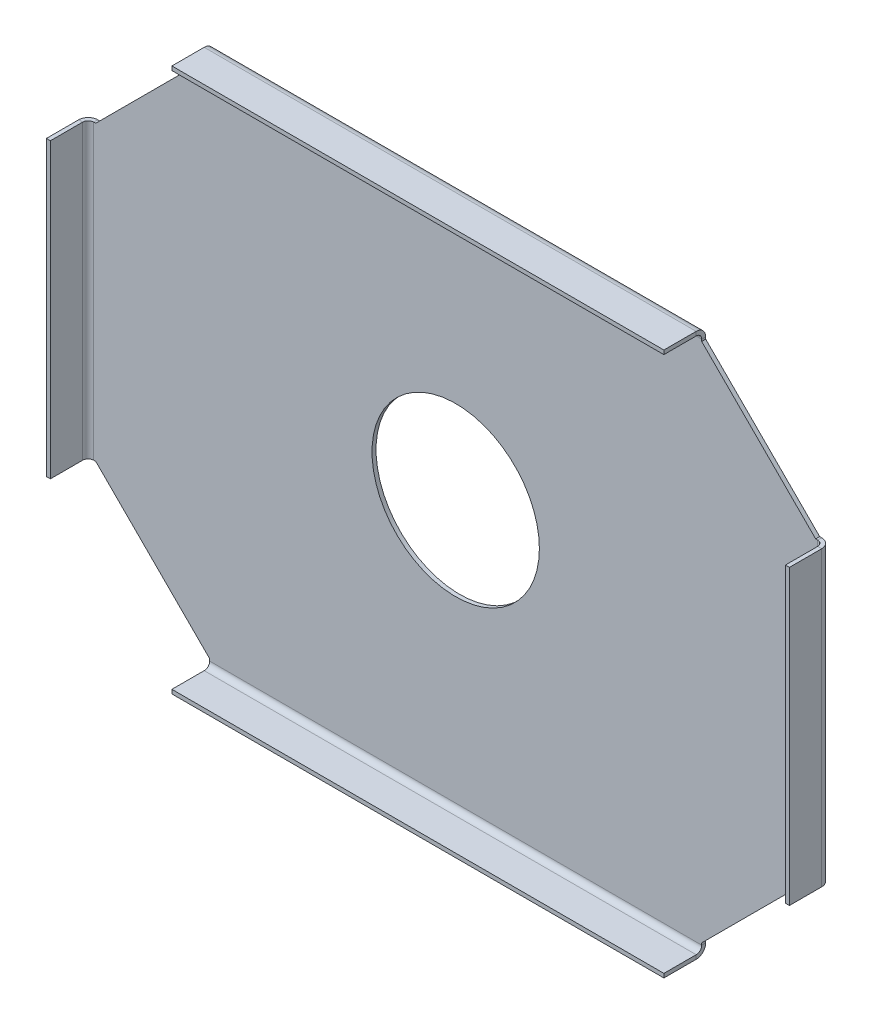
ISO-10303-21;
HEADER;
FILE_DESCRIPTION(('STEP AP214'),'2;1');
FILE_NAME('part.step','',(''),(''),'','','');
FILE_SCHEMA(('AUTOMOTIVE_DESIGN { 1 0 10303 214 1 1 1 1 }'));
ENDSEC;
DATA;
#1=APPLICATION_CONTEXT('core data for automotive mechanical design processes');
#2=APPLICATION_PROTOCOL_DEFINITION('international standard','automotive_design',2000,#1);
#3=PRODUCT_CONTEXT('',#1,'mechanical');
#4=PRODUCT('Part','Part','',(#3));
#5=PRODUCT_RELATED_PRODUCT_CATEGORY('part','',(#4));
#6=PRODUCT_DEFINITION_FORMATION('','',#4);
#7=PRODUCT_DEFINITION_CONTEXT('part definition',#1,'design');
#8=PRODUCT_DEFINITION('design','',#6,#7);
#9=PRODUCT_DEFINITION_SHAPE('','',#8);
#10=(LENGTH_UNIT() NAMED_UNIT(*) SI_UNIT(.MILLI.,.METRE.));
#11=(NAMED_UNIT(*) PLANE_ANGLE_UNIT() SI_UNIT($,.RADIAN.));
#12=(NAMED_UNIT(*) SI_UNIT($,.STERADIAN.) SOLID_ANGLE_UNIT());
#13=UNCERTAINTY_MEASURE_WITH_UNIT(LENGTH_MEASURE(1.E-05),#10,'distance_accuracy_value','');
#14=(GEOMETRIC_REPRESENTATION_CONTEXT(3) GLOBAL_UNCERTAINTY_ASSIGNED_CONTEXT((#13)) GLOBAL_UNIT_ASSIGNED_CONTEXT((#10,
#11,#12)) REPRESENTATION_CONTEXT('',''));
#15=CARTESIAN_POINT('',(0.,0.,0.));
#16=DIRECTION('',(0.,0.,1.));
#17=DIRECTION('',(1.,0.,0.));
#18=AXIS2_PLACEMENT_3D('',#15,#16,#17);
#19=CARTESIAN_POINT('',(0.,0.,-1.2192));
#20=DIRECTION('',(0.,0.,1.));
#21=DIRECTION('',(1.,0.,0.));
#22=AXIS2_PLACEMENT_3D('',#19,#20,#21);
#23=PLANE('',#22);
#24=CARTESIAN_POINT('',(0.,0.,-1.21920000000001));
#25=DIRECTION('',(0.,0.,1.));
#26=DIRECTION('',(1.,0.,0.));
#27=AXIS2_PLACEMENT_3D('',#24,#25,#26);
#28=CIRCLE('',#27,25.4);
#29=CARTESIAN_POINT('',(25.4,0.,-1.21920000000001));
#30=VERTEX_POINT('',#29);
#31=EDGE_CURVE('E385',#30,#30,#28,.T.);
#32=ORIENTED_EDGE('',*,*,#31,.T.);
#33=EDGE_LOOP('',(#32));
#34=FACE_BOUND('',#33,.T.);
#35=DIRECTION('',(0.,1.,0.));
#36=VECTOR('',#35,1.);
#37=CARTESIAN_POINT('',(74.6759999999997,0.,-1.2192));
#38=LINE('',#37,#36);
#39=CARTESIAN_POINT('',(74.6759999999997,79.0448000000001,-1.2192));
#40=VERTEX_POINT('',#39);
#41=CARTESIAN_POINT('',(74.6759999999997,79.6544000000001,-1.2192));
#42=VERTEX_POINT('',#41);
#43=EDGE_CURVE('E384',#40,#42,#38,.T.);
#44=ORIENTED_EDGE('',*,*,#43,.F.);
#45=DIRECTION('',(0.707106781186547,-0.707106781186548,0.));
#46=VECTOR('',#45,1.);
#47=CARTESIAN_POINT('',(74.6759999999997,79.0448,-1.21920000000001));
#48=LINE('',#47,#46);
#49=CARTESIAN_POINT('',(109.2708,44.4499999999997,-1.21920000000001));
#50=VERTEX_POINT('',#49);
#51=EDGE_CURVE('E376',#40,#50,#48,.T.);
#52=ORIENTED_EDGE('',*,*,#51,.T.);
#53=DIRECTION('',(-1.,0.,0.));
#54=VECTOR('',#53,1.);
#55=CARTESIAN_POINT('',(0.,44.4499999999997,-1.2192));
#56=LINE('',#55,#54);
#57=CARTESIAN_POINT('',(109.8804,44.4499999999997,-1.21920000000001));
#58=VERTEX_POINT('',#57);
#59=EDGE_CURVE('E13',#58,#50,#56,.T.);
#60=ORIENTED_EDGE('',*,*,#59,.F.);
#61=DIRECTION('',(0.,1.,0.));
#62=VECTOR('',#61,1.);
#63=CARTESIAN_POINT('',(109.8804,44.4499999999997,-1.21920000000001));
#64=LINE('',#63,#62);
#65=CARTESIAN_POINT('',(109.8804,-44.4499999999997,-1.2192));
#66=VERTEX_POINT('',#65);
#67=EDGE_CURVE('E400',#58,#66,#64,.F.);
#68=ORIENTED_EDGE('',*,*,#67,.T.);
#69=DIRECTION('',(1.,0.,0.));
#70=VECTOR('',#69,1.);
#71=CARTESIAN_POINT('',(0.,-44.4499999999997,-1.2192));
#72=LINE('',#71,#70);
#73=CARTESIAN_POINT('',(109.2708,-44.4499999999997,-1.21920000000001));
#74=VERTEX_POINT('',#73);
#75=EDGE_CURVE('E129',#74,#66,#72,.T.);
#76=ORIENTED_EDGE('',*,*,#75,.F.);
#77=DIRECTION('',(-0.707106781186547,-0.707106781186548,0.));
#78=VECTOR('',#77,1.);
#79=CARTESIAN_POINT('',(74.6759999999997,-79.0448,-1.21920000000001));
#80=LINE('',#79,#78);
#81=CARTESIAN_POINT('',(74.6759999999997,-79.0448,-1.21920000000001));
#82=VERTEX_POINT('',#81);
#83=EDGE_CURVE('E340',#74,#82,#80,.T.);
#84=ORIENTED_EDGE('',*,*,#83,.T.);
#85=DIRECTION('',(0.,1.,0.));
#86=VECTOR('',#85,1.);
#87=CARTESIAN_POINT('',(74.6759999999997,0.,-1.2192));
#88=LINE('',#87,#86);
#89=CARTESIAN_POINT('',(74.6759999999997,-79.6544,-1.21920000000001));
#90=VERTEX_POINT('',#89);
#91=EDGE_CURVE('E355',#90,#82,#88,.T.);
#92=ORIENTED_EDGE('',*,*,#91,.F.);
#93=DIRECTION('',(1.,0.,0.));
#94=VECTOR('',#93,1.);
#95=CARTESIAN_POINT('',(74.6759999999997,-79.6544,-1.21920000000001));
#96=LINE('',#95,#94);
#97=CARTESIAN_POINT('',(-74.6759999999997,-79.6544,-1.2192));
#98=VERTEX_POINT('',#97);
#99=EDGE_CURVE('E353',#90,#98,#96,.F.);
#100=ORIENTED_EDGE('',*,*,#99,.T.);
#101=DIRECTION('',(0.,-1.,0.));
#102=VECTOR('',#101,1.);
#103=CARTESIAN_POINT('',(-74.6759999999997,0.,-1.2192));
#104=LINE('',#103,#102);
#105=CARTESIAN_POINT('',(-74.6759999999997,-79.0448,-1.21920000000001));
#106=VERTEX_POINT('',#105);
#107=EDGE_CURVE('E345',#106,#98,#104,.T.);
#108=ORIENTED_EDGE('',*,*,#107,.F.);
#109=DIRECTION('',(-0.707106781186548,0.707106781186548,0.));
#110=VECTOR('',#109,1.);
#111=CARTESIAN_POINT('',(-109.2708,-44.4499999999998,-1.21920000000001));
#112=LINE('',#111,#110);
#113=CARTESIAN_POINT('',(-109.2708,-44.4499999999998,-1.21920000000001));
#114=VERTEX_POINT('',#113);
#115=EDGE_CURVE('E329',#106,#114,#112,.T.);
#116=ORIENTED_EDGE('',*,*,#115,.T.);
#117=DIRECTION('',(1.,0.,0.));
#118=VECTOR('',#117,1.);
#119=CARTESIAN_POINT('',(0.,-44.4499999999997,-1.2192));
#120=LINE('',#119,#118);
#121=CARTESIAN_POINT('',(-109.8804,-44.4499999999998,-1.21919999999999));
#122=VERTEX_POINT('',#121);
#123=EDGE_CURVE('E349',#122,#114,#120,.T.);
#124=ORIENTED_EDGE('',*,*,#123,.F.);
#125=DIRECTION('',(0.,-1.,0.));
#126=VECTOR('',#125,1.);
#127=CARTESIAN_POINT('',(-109.8804,-44.4499999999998,-1.21919999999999));
#128=LINE('',#127,#126);
#129=CARTESIAN_POINT('',(-109.8804,44.4499999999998,-1.2192));
#130=VERTEX_POINT('',#129);
#131=EDGE_CURVE('E1215',#122,#130,#128,.F.);
#132=ORIENTED_EDGE('',*,*,#131,.T.);
#133=DIRECTION('',(-1.,0.,0.));
#134=VECTOR('',#133,1.);
#135=CARTESIAN_POINT('',(0.,44.4499999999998,-1.2192));
#136=LINE('',#135,#134);
#137=CARTESIAN_POINT('',(-109.2708,44.4499999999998,-1.21920000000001));
#138=VERTEX_POINT('',#137);
#139=EDGE_CURVE('E439',#138,#130,#136,.T.);
#140=ORIENTED_EDGE('',*,*,#139,.F.);
#141=DIRECTION('',(0.707106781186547,0.707106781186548,0.));
#142=VECTOR('',#141,1.);
#143=CARTESIAN_POINT('',(-109.2708,44.4499999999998,-1.21920000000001));
#144=LINE('',#143,#142);
#145=CARTESIAN_POINT('',(-74.6759999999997,79.0448,-1.21920000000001));
#146=VERTEX_POINT('',#145);
#147=EDGE_CURVE('E339',#138,#146,#144,.T.);
#148=ORIENTED_EDGE('',*,*,#147,.T.);
#149=DIRECTION('',(0.,-1.,0.));
#150=VECTOR('',#149,1.);
#151=CARTESIAN_POINT('',(-74.6759999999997,0.,-1.2192));
#152=LINE('',#151,#150);
#153=CARTESIAN_POINT('',(-74.6759999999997,79.6544000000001,-1.21919999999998));
#154=VERTEX_POINT('',#153);
#155=EDGE_CURVE('E433',#154,#146,#152,.T.);
#156=ORIENTED_EDGE('',*,*,#155,.F.);
#157=DIRECTION('',(-1.,0.,0.));
#158=VECTOR('',#157,1.);
#159=CARTESIAN_POINT('',(-74.6759999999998,79.6544000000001,-1.21919999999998));
#160=LINE('',#159,#158);
#161=EDGE_CURVE('E1162',#154,#42,#160,.F.);
#162=ORIENTED_EDGE('',*,*,#161,.T.);
#163=EDGE_LOOP('',(#44,#52,#60,#68,#76,#84,#92,#100,#108,#116,#124,#132,#140,#148,#156,#162));
#164=FACE_BOUND('',#163,.T.);
#165=ADVANCED_FACE('F120',(#34,#164),#23,.F.);
#166=CARTESIAN_POINT('',(0.,0.,0.));
#167=DIRECTION('',(0.,0.,1.));
#168=DIRECTION('',(1.,0.,0.));
#169=AXIS2_PLACEMENT_3D('',#166,#167,#168);
#170=PLANE('',#169);
#171=CARTESIAN_POINT('',(0.,0.,0.));
#172=DIRECTION('',(0.,0.,1.));
#173=DIRECTION('',(1.,0.,0.));
#174=AXIS2_PLACEMENT_3D('',#171,#172,#173);
#175=CIRCLE('',#174,25.4);
#176=CARTESIAN_POINT('',(25.4,0.,0.));
#177=VERTEX_POINT('',#176);
#178=EDGE_CURVE('E124',#177,#177,#175,.T.);
#179=ORIENTED_EDGE('',*,*,#178,.F.);
#180=EDGE_LOOP('',(#179));
#181=FACE_BOUND('',#180,.T.);
#182=DIRECTION('',(0.707106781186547,-0.707106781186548,0.));
#183=VECTOR('',#182,1.);
#184=CARTESIAN_POINT('',(76.8603999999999,76.8603999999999,0.));
#185=LINE('',#184,#183);
#186=CARTESIAN_POINT('',(74.6759999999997,79.0448,0.));
#187=VERTEX_POINT('',#186);
#188=CARTESIAN_POINT('',(109.2708,44.4499999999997,0.));
#189=VERTEX_POINT('',#188);
#190=EDGE_CURVE('E379',#187,#189,#185,.T.);
#191=ORIENTED_EDGE('',*,*,#190,.F.);
#192=DIRECTION('',(0.,-1.,0.));
#193=VECTOR('',#192,1.);
#194=CARTESIAN_POINT('',(74.6759999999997,79.6544,0.));
#195=LINE('',#194,#193);
#196=CARTESIAN_POINT('',(74.6759999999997,79.6544,0.));
#197=VERTEX_POINT('',#196);
#198=EDGE_CURVE('E427',#197,#187,#195,.T.);
#199=ORIENTED_EDGE('',*,*,#198,.F.);
#200=DIRECTION('',(-1.,0.,0.));
#201=VECTOR('',#200,1.);
#202=CARTESIAN_POINT('',(-74.6759999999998,79.6544,0.));
#203=LINE('',#202,#201);
#204=CARTESIAN_POINT('',(-74.6759999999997,79.6544,0.));
#205=VERTEX_POINT('',#204);
#206=EDGE_CURVE('E1174',#205,#197,#203,.F.);
#207=ORIENTED_EDGE('',*,*,#206,.F.);
#208=DIRECTION('',(0.,1.,0.));
#209=VECTOR('',#208,1.);
#210=CARTESIAN_POINT('',(-74.6759999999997,79.0448,0.));
#211=LINE('',#210,#209);
#212=CARTESIAN_POINT('',(-74.6759999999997,79.0448,0.));
#213=VERTEX_POINT('',#212);
#214=EDGE_CURVE('E424',#213,#205,#211,.T.);
#215=ORIENTED_EDGE('',*,*,#214,.F.);
#216=DIRECTION('',(0.707106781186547,0.707106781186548,0.));
#217=VECTOR('',#216,1.);
#218=CARTESIAN_POINT('',(-76.8603999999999,76.8603999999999,0.));
#219=LINE('',#218,#217);
#220=CARTESIAN_POINT('',(-109.2708,44.4499999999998,0.));
#221=VERTEX_POINT('',#220);
#222=EDGE_CURVE('E1126',#221,#213,#219,.T.);
#223=ORIENTED_EDGE('',*,*,#222,.F.);
#224=DIRECTION('',(1.,0.,0.));
#225=VECTOR('',#224,1.);
#226=CARTESIAN_POINT('',(-109.8804,44.4499999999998,0.));
#227=LINE('',#226,#225);
#228=CARTESIAN_POINT('',(-109.8804,44.4499999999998,0.));
#229=VERTEX_POINT('',#228);
#230=EDGE_CURVE('E440',#229,#221,#227,.T.);
#231=ORIENTED_EDGE('',*,*,#230,.F.);
#232=DIRECTION('',(0.,-1.,0.));
#233=VECTOR('',#232,1.);
#234=CARTESIAN_POINT('',(-109.8804,-44.4499999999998,0.));
#235=LINE('',#234,#233);
#236=CARTESIAN_POINT('',(-109.8804,-44.4499999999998,0.));
#237=VERTEX_POINT('',#236);
#238=EDGE_CURVE('E1228',#237,#229,#235,.F.);
#239=ORIENTED_EDGE('',*,*,#238,.F.);
#240=DIRECTION('',(-1.,0.,0.));
#241=VECTOR('',#240,1.);
#242=CARTESIAN_POINT('',(-109.2708,-44.4499999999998,0.));
#243=LINE('',#242,#241);
#244=CARTESIAN_POINT('',(-109.2708,-44.4499999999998,0.));
#245=VERTEX_POINT('',#244);
#246=EDGE_CURVE('E437',#245,#237,#243,.T.);
#247=ORIENTED_EDGE('',*,*,#246,.F.);
#248=DIRECTION('',(-0.707106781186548,0.707106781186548,0.));
#249=VECTOR('',#248,1.);
#250=CARTESIAN_POINT('',(-76.8603999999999,-76.8603999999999,0.));
#251=LINE('',#250,#249);
#252=CARTESIAN_POINT('',(-74.6759999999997,-79.0448,0.));
#253=VERTEX_POINT('',#252);
#254=EDGE_CURVE('E1128',#253,#245,#251,.T.);
#255=ORIENTED_EDGE('',*,*,#254,.F.);
#256=DIRECTION('',(0.,1.,0.));
#257=VECTOR('',#256,1.);
#258=CARTESIAN_POINT('',(-74.6759999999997,-79.6544,0.));
#259=LINE('',#258,#257);
#260=CARTESIAN_POINT('',(-74.6759999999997,-79.6544,0.));
#261=VERTEX_POINT('',#260);
#262=EDGE_CURVE('E348',#261,#253,#259,.T.);
#263=ORIENTED_EDGE('',*,*,#262,.F.);
#264=DIRECTION('',(1.,0.,0.));
#265=VECTOR('',#264,1.);
#266=CARTESIAN_POINT('',(74.6759999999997,-79.6544,0.));
#267=LINE('',#266,#265);
#268=CARTESIAN_POINT('',(74.6759999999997,-79.6544,0.));
#269=VERTEX_POINT('',#268);
#270=EDGE_CURVE('E483',#269,#261,#267,.F.);
#271=ORIENTED_EDGE('',*,*,#270,.F.);
#272=DIRECTION('',(0.,-1.,0.));
#273=VECTOR('',#272,1.);
#274=CARTESIAN_POINT('',(74.6759999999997,-79.0448,0.));
#275=LINE('',#274,#273);
#276=CARTESIAN_POINT('',(74.6759999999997,-79.0448,0.));
#277=VERTEX_POINT('',#276);
#278=EDGE_CURVE('E356',#277,#269,#275,.T.);
#279=ORIENTED_EDGE('',*,*,#278,.F.);
#280=DIRECTION('',(-0.707106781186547,-0.707106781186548,0.));
#281=VECTOR('',#280,1.);
#282=CARTESIAN_POINT('',(76.8603999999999,-76.8603999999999,0.));
#283=LINE('',#282,#281);
#284=CARTESIAN_POINT('',(109.2708,-44.4499999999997,0.));
#285=VERTEX_POINT('',#284);
#286=EDGE_CURVE('E453',#285,#277,#283,.T.);
#287=ORIENTED_EDGE('',*,*,#286,.F.);
#288=DIRECTION('',(-1.,0.,0.));
#289=VECTOR('',#288,1.);
#290=CARTESIAN_POINT('',(109.8804,-44.4499999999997,0.));
#291=LINE('',#290,#289);
#292=CARTESIAN_POINT('',(109.8804,-44.4499999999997,0.));
#293=VERTEX_POINT('',#292);
#294=EDGE_CURVE('E368',#293,#285,#291,.T.);
#295=ORIENTED_EDGE('',*,*,#294,.F.);
#296=DIRECTION('',(0.,1.,0.));
#297=VECTOR('',#296,1.);
#298=CARTESIAN_POINT('',(109.8804,44.4499999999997,0.));
#299=LINE('',#298,#297);
#300=CARTESIAN_POINT('',(109.8804,44.4499999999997,0.));
#301=VERTEX_POINT('',#300);
#302=EDGE_CURVE('E413',#301,#293,#299,.F.);
#303=ORIENTED_EDGE('',*,*,#302,.F.);
#304=DIRECTION('',(1.,0.,0.));
#305=VECTOR('',#304,1.);
#306=CARTESIAN_POINT('',(109.2708,44.4499999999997,0.));
#307=LINE('',#306,#305);
#308=EDGE_CURVE('E365',#189,#301,#307,.T.);
#309=ORIENTED_EDGE('',*,*,#308,.F.);
#310=EDGE_LOOP('',(#191,#199,#207,#215,#223,#231,#239,#247,#255,#263,#271,#279,#287,#295,#303,#309));
#311=FACE_BOUND('',#310,.T.);
#312=ADVANCED_FACE('F122',(#181,#311),#170,.T.);
#313=CARTESIAN_POINT('',(109.2708,44.4499999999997,0.));
#314=DIRECTION('',(0.,1.,0.));
#315=DIRECTION('',(0.,0.,1.));
#316=AXIS2_PLACEMENT_3D('',#313,#314,#315);
#317=PLANE('',#316);
#318=DIRECTION('',(0.,0.,-1.));
#319=VECTOR('',#318,1.);
#320=CARTESIAN_POINT('',(109.8804,44.4499999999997,0.));
#321=LINE('',#320,#319);
#322=EDGE_CURVE('E389',#301,#58,#321,.T.);
#323=ORIENTED_EDGE('',*,*,#322,.T.);
#324=ORIENTED_EDGE('',*,*,#59,.T.);
#325=DIRECTION('',(0.,0.,-1.));
#326=VECTOR('',#325,1.);
#327=CARTESIAN_POINT('',(109.2708,44.4499999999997,0.));
#328=LINE('',#327,#326);
#329=EDGE_CURVE('E367',#189,#50,#328,.T.);
#330=ORIENTED_EDGE('',*,*,#329,.F.);
#331=ORIENTED_EDGE('',*,*,#308,.T.);
#332=EDGE_LOOP('',(#323,#324,#330,#331));
#333=FACE_BOUND('',#332,.T.);
#334=ADVANCED_FACE('F387',(#333),#317,.T.);
#335=CARTESIAN_POINT('',(109.8804,-44.4499999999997,0.));
#336=DIRECTION('',(0.,-1.,0.));
#337=DIRECTION('',(0.,0.,-1.));
#338=AXIS2_PLACEMENT_3D('',#335,#336,#337);
#339=PLANE('',#338);
#340=DIRECTION('',(0.,0.,-1.));
#341=VECTOR('',#340,1.);
#342=CARTESIAN_POINT('',(109.2708,-44.4499999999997,0.));
#343=LINE('',#342,#341);
#344=EDGE_CURVE('E359',#285,#74,#343,.T.);
#345=ORIENTED_EDGE('',*,*,#344,.T.);
#346=ORIENTED_EDGE('',*,*,#75,.T.);
#347=DIRECTION('',(0.,0.,-1.));
#348=VECTOR('',#347,1.);
#349=CARTESIAN_POINT('',(109.8804,-44.4499999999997,0.));
#350=LINE('',#349,#348);
#351=EDGE_CURVE('E140',#293,#66,#350,.T.);
#352=ORIENTED_EDGE('',*,*,#351,.F.);
#353=ORIENTED_EDGE('',*,*,#294,.T.);
#354=EDGE_LOOP('',(#345,#346,#352,#353));
#355=FACE_BOUND('',#354,.T.);
#356=ADVANCED_FACE('F561',(#355),#339,.T.);
#357=CARTESIAN_POINT('',(74.6759999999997,-79.0448,0.));
#358=DIRECTION('',(1.,0.,0.));
#359=DIRECTION('',(0.,0.,-1.));
#360=AXIS2_PLACEMENT_3D('',#357,#358,#359);
#361=PLANE('',#360);
#362=DIRECTION('',(0.,0.,-1.));
#363=VECTOR('',#362,1.);
#364=CARTESIAN_POINT('',(74.6759999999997,-79.6544,0.));
#365=LINE('',#364,#363);
#366=EDGE_CURVE('E460',#269,#90,#365,.T.);
#367=ORIENTED_EDGE('',*,*,#366,.T.);
#368=ORIENTED_EDGE('',*,*,#91,.T.);
#369=DIRECTION('',(0.,0.,-1.));
#370=VECTOR('',#369,1.);
#371=CARTESIAN_POINT('',(74.6759999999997,-79.0448,0.));
#372=LINE('',#371,#370);
#373=EDGE_CURVE('E361',#277,#82,#372,.T.);
#374=ORIENTED_EDGE('',*,*,#373,.F.);
#375=ORIENTED_EDGE('',*,*,#278,.T.);
#376=EDGE_LOOP('',(#367,#368,#374,#375));
#377=FACE_BOUND('',#376,.T.);
#378=ADVANCED_FACE('F458',(#377),#361,.T.);
#379=CARTESIAN_POINT('',(-74.6759999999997,-79.6544,0.));
#380=DIRECTION('',(-1.,0.,0.));
#381=DIRECTION('',(0.,0.,1.));
#382=AXIS2_PLACEMENT_3D('',#379,#380,#381);
#383=PLANE('',#382);
#384=DIRECTION('',(0.,0.,-1.));
#385=VECTOR('',#384,1.);
#386=CARTESIAN_POINT('',(-74.6759999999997,-79.0448,0.));
#387=LINE('',#386,#385);
#388=EDGE_CURVE('E332',#253,#106,#387,.T.);
#389=ORIENTED_EDGE('',*,*,#388,.T.);
#390=ORIENTED_EDGE('',*,*,#107,.T.);
#391=DIRECTION('',(0.,0.,-1.));
#392=VECTOR('',#391,1.);
#393=CARTESIAN_POINT('',(-74.6759999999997,-79.6544,0.));
#394=LINE('',#393,#392);
#395=EDGE_CURVE('E466',#261,#98,#394,.T.);
#396=ORIENTED_EDGE('',*,*,#395,.F.);
#397=ORIENTED_EDGE('',*,*,#262,.T.);
#398=EDGE_LOOP('',(#389,#390,#396,#397));
#399=FACE_BOUND('',#398,.T.);
#400=ADVANCED_FACE('F344',(#399),#383,.T.);
#401=CARTESIAN_POINT('',(-109.2708,-44.4499999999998,0.));
#402=DIRECTION('',(0.,-1.,0.));
#403=DIRECTION('',(0.,0.,-1.));
#404=AXIS2_PLACEMENT_3D('',#401,#402,#403);
#405=PLANE('',#404);
#406=DIRECTION('',(0.,0.,-1.));
#407=VECTOR('',#406,1.);
#408=CARTESIAN_POINT('',(-109.8804,-44.4499999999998,0.));
#409=LINE('',#408,#407);
#410=EDGE_CURVE('E1222',#237,#122,#409,.T.);
#411=ORIENTED_EDGE('',*,*,#410,.T.);
#412=ORIENTED_EDGE('',*,*,#123,.T.);
#413=DIRECTION('',(0.,0.,-1.));
#414=VECTOR('',#413,1.);
#415=CARTESIAN_POINT('',(-109.2708,-44.4499999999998,0.));
#416=LINE('',#415,#414);
#417=EDGE_CURVE('E335',#245,#114,#416,.T.);
#418=ORIENTED_EDGE('',*,*,#417,.F.);
#419=ORIENTED_EDGE('',*,*,#246,.T.);
#420=EDGE_LOOP('',(#411,#412,#418,#419));
#421=FACE_BOUND('',#420,.T.);
#422=ADVANCED_FACE('F568',(#421),#405,.T.);
#423=CARTESIAN_POINT('',(-109.8804,44.4499999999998,0.));
#424=DIRECTION('',(0.,1.,0.));
#425=DIRECTION('',(0.,0.,1.));
#426=AXIS2_PLACEMENT_3D('',#423,#424,#425);
#427=PLANE('',#426);
#428=DIRECTION('',(0.,0.,-1.));
#429=VECTOR('',#428,1.);
#430=CARTESIAN_POINT('',(-109.2708,44.4499999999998,0.));
#431=LINE('',#430,#429);
#432=EDGE_CURVE('E436',#221,#138,#431,.T.);
#433=ORIENTED_EDGE('',*,*,#432,.T.);
#434=ORIENTED_EDGE('',*,*,#139,.T.);
#435=DIRECTION('',(0.,0.,-1.));
#436=VECTOR('',#435,1.);
#437=CARTESIAN_POINT('',(-109.8804,44.4499999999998,0.));
#438=LINE('',#437,#436);
#439=EDGE_CURVE('E1233',#229,#130,#438,.T.);
#440=ORIENTED_EDGE('',*,*,#439,.F.);
#441=ORIENTED_EDGE('',*,*,#230,.T.);
#442=EDGE_LOOP('',(#433,#434,#440,#441));
#443=FACE_BOUND('',#442,.T.);
#444=ADVANCED_FACE('F571',(#443),#427,.T.);
#445=CARTESIAN_POINT('',(-74.6759999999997,79.0448,0.));
#446=DIRECTION('',(-1.,0.,0.));
#447=DIRECTION('',(0.,0.,1.));
#448=AXIS2_PLACEMENT_3D('',#445,#446,#447);
#449=PLANE('',#448);
#450=DIRECTION('',(0.,0.,-1.));
#451=VECTOR('',#450,1.);
#452=CARTESIAN_POINT('',(-74.6759999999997,79.6544,0.));
#453=LINE('',#452,#451);
#454=EDGE_CURVE('E1168',#205,#154,#453,.T.);
#455=ORIENTED_EDGE('',*,*,#454,.T.);
#456=ORIENTED_EDGE('',*,*,#155,.T.);
#457=DIRECTION('',(0.,0.,-1.));
#458=VECTOR('',#457,1.);
#459=CARTESIAN_POINT('',(-74.6759999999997,79.0448,0.));
#460=LINE('',#459,#458);
#461=EDGE_CURVE('E426',#213,#146,#460,.T.);
#462=ORIENTED_EDGE('',*,*,#461,.F.);
#463=ORIENTED_EDGE('',*,*,#214,.T.);
#464=EDGE_LOOP('',(#455,#456,#462,#463));
#465=FACE_BOUND('',#464,.T.);
#466=ADVANCED_FACE('F575',(#465),#449,.T.);
#467=CARTESIAN_POINT('',(74.6759999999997,79.6544,0.));
#468=DIRECTION('',(1.,0.,0.));
#469=DIRECTION('',(0.,0.,-1.));
#470=AXIS2_PLACEMENT_3D('',#467,#468,#469);
#471=PLANE('',#470);
#472=DIRECTION('',(0.,0.,-1.));
#473=VECTOR('',#472,1.);
#474=CARTESIAN_POINT('',(74.6759999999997,79.0448,0.));
#475=LINE('',#474,#473);
#476=EDGE_CURVE('E422',#187,#40,#475,.T.);
#477=ORIENTED_EDGE('',*,*,#476,.T.);
#478=ORIENTED_EDGE('',*,*,#43,.T.);
#479=DIRECTION('',(0.,0.,-1.));
#480=VECTOR('',#479,1.);
#481=CARTESIAN_POINT('',(74.6759999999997,79.6544,0.));
#482=LINE('',#481,#480);
#483=EDGE_CURVE('E1179',#197,#42,#482,.T.);
#484=ORIENTED_EDGE('',*,*,#483,.F.);
#485=ORIENTED_EDGE('',*,*,#198,.T.);
#486=EDGE_LOOP('',(#477,#478,#484,#485));
#487=FACE_BOUND('',#486,.T.);
#488=ADVANCED_FACE('F579',(#487),#471,.T.);
#489=CARTESIAN_POINT('',(109.8804,-44.4499999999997,1.6764));
#490=DIRECTION('',(0.,-1.,0.));
#491=DIRECTION('',(0.,0.,-1.));
#492=AXIS2_PLACEMENT_3D('',#489,#490,#491);
#493=PLANE('',#492);
#494=DIRECTION('',(-1.,0.,0.));
#495=VECTOR('',#494,1.);
#496=CARTESIAN_POINT('',(112.776,-44.4499999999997,1.67639999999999));
#497=LINE('',#496,#495);
#498=CARTESIAN_POINT('',(111.5568,-44.4499999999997,1.6764));
#499=VERTEX_POINT('',#498);
#500=CARTESIAN_POINT('',(112.776,-44.4499999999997,1.67639999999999));
#501=VERTEX_POINT('',#500);
#502=EDGE_CURVE('E492',#499,#501,#497,.F.);
#503=ORIENTED_EDGE('',*,*,#502,.F.);
#504=CARTESIAN_POINT('',(109.8804,-44.4499999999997,1.6764));
#505=DIRECTION('',(0.,1.,0.));
#506=DIRECTION('',(0.,0.,1.));
#507=AXIS2_PLACEMENT_3D('',#504,#505,#506);
#508=CIRCLE('',#507,1.67639999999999);
#509=EDGE_CURVE('E410',#293,#499,#508,.F.);
#510=ORIENTED_EDGE('',*,*,#509,.F.);
#511=ORIENTED_EDGE('',*,*,#351,.T.);
#512=CARTESIAN_POINT('',(109.8804,-44.4499999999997,1.6764));
#513=DIRECTION('',(0.,1.,0.));
#514=DIRECTION('',(0.,0.,1.));
#515=AXIS2_PLACEMENT_3D('',#512,#513,#514);
#516=CIRCLE('',#515,2.89559999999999);
#517=EDGE_CURVE('E396',#66,#501,#516,.F.);
#518=ORIENTED_EDGE('',*,*,#517,.T.);
#519=EDGE_LOOP('',(#503,#510,#511,#518));
#520=FACE_BOUND('',#519,.T.);
#521=ADVANCED_FACE('F583',(#520),#493,.T.);
#522=CARTESIAN_POINT('',(109.8804,44.4499999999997,1.67639999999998));
#523=DIRECTION('',(0.,-1.,0.));
#524=DIRECTION('',(0.,0.,-1.));
#525=AXIS2_PLACEMENT_3D('',#522,#523,#524);
#526=PLANE('',#525);
#527=CARTESIAN_POINT('',(109.8804,44.4499999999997,1.67639999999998));
#528=DIRECTION('',(0.,1.,0.));
#529=DIRECTION('',(0.,0.,1.));
#530=AXIS2_PLACEMENT_3D('',#527,#528,#529);
#531=CIRCLE('',#530,1.67639999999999);
#532=CARTESIAN_POINT('',(111.5568,44.4499999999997,1.67639999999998));
#533=VERTEX_POINT('',#532);
#534=EDGE_CURVE('E419',#533,#301,#531,.T.);
#535=ORIENTED_EDGE('',*,*,#534,.F.);
#536=DIRECTION('',(-1.,0.,0.));
#537=VECTOR('',#536,1.);
#538=CARTESIAN_POINT('',(111.5568,44.4499999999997,1.67639999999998));
#539=LINE('',#538,#537);
#540=CARTESIAN_POINT('',(112.776,44.4499999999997,1.67639999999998));
#541=VERTEX_POINT('',#540);
#542=EDGE_CURVE('E408',#533,#541,#539,.F.);
#543=ORIENTED_EDGE('',*,*,#542,.T.);
#544=CARTESIAN_POINT('',(109.8804,44.4499999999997,1.67639999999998));
#545=DIRECTION('',(0.,1.,0.));
#546=DIRECTION('',(0.,0.,1.));
#547=AXIS2_PLACEMENT_3D('',#544,#545,#546);
#548=CIRCLE('',#547,2.89559999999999);
#549=EDGE_CURVE('E402',#541,#58,#548,.T.);
#550=ORIENTED_EDGE('',*,*,#549,.T.);
#551=ORIENTED_EDGE('',*,*,#322,.F.);
#552=EDGE_LOOP('',(#535,#543,#550,#551));
#553=FACE_BOUND('',#552,.T.);
#554=ADVANCED_FACE('F406',(#553),#526,.F.);
#555=CARTESIAN_POINT('',(109.8804,44.4499999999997,1.67639999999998));
#556=DIRECTION('',(0.,1.,0.));
#557=DIRECTION('',(1.,0.,0.));
#558=AXIS2_PLACEMENT_3D('',#555,#556,#557);
#559=CYLINDRICAL_SURFACE('',#558,2.89559999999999);
#560=ORIENTED_EDGE('',*,*,#67,.F.);
#561=ORIENTED_EDGE('',*,*,#549,.F.);
#562=DIRECTION('',(0.,1.,0.));
#563=VECTOR('',#562,1.);
#564=CARTESIAN_POINT('',(112.776,-44.4499999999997,1.67639999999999));
#565=LINE('',#564,#563);
#566=EDGE_CURVE('E513',#541,#501,#565,.F.);
#567=ORIENTED_EDGE('',*,*,#566,.T.);
#568=ORIENTED_EDGE('',*,*,#517,.F.);
#569=EDGE_LOOP('',(#560,#561,#567,#568));
#570=FACE_BOUND('',#569,.T.);
#571=ADVANCED_FACE('F401',(#570),#559,.T.);
#572=CARTESIAN_POINT('',(109.8804,44.4499999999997,1.67639999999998));
#573=DIRECTION('',(0.,1.,0.));
#574=DIRECTION('',(1.,0.,0.));
#575=AXIS2_PLACEMENT_3D('',#572,#573,#574);
#576=CYLINDRICAL_SURFACE('',#575,1.67639999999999);
#577=ORIENTED_EDGE('',*,*,#302,.T.);
#578=ORIENTED_EDGE('',*,*,#509,.T.);
#579=DIRECTION('',(0.,1.,0.));
#580=VECTOR('',#579,1.);
#581=CARTESIAN_POINT('',(111.5568,-44.4499999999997,1.67639999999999));
#582=LINE('',#581,#580);
#583=EDGE_CURVE('E516',#499,#533,#582,.T.);
#584=ORIENTED_EDGE('',*,*,#583,.T.);
#585=ORIENTED_EDGE('',*,*,#534,.T.);
#586=EDGE_LOOP('',(#577,#578,#584,#585));
#587=FACE_BOUND('',#586,.T.);
#588=ADVANCED_FACE('F539',(#587),#576,.F.);
#589=CARTESIAN_POINT('',(112.776,-44.4499999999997,0.));
#590=DIRECTION('',(0.,1.,0.));
#591=DIRECTION('',(-1.,0.,0.));
#592=AXIS2_PLACEMENT_3D('',#589,#590,#591);
#593=PLANE('',#592);
#594=ORIENTED_EDGE('',*,*,#502,.T.);
#595=DIRECTION('',(0.,0.,-1.));
#596=VECTOR('',#595,1.);
#597=CARTESIAN_POINT('',(112.776,-44.4499999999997,-2.76900078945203E-13));
#598=LINE('',#597,#596);
#599=CARTESIAN_POINT('',(112.776,-44.4499999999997,11.4808));
#600=VERTEX_POINT('',#599);
#601=EDGE_CURVE('E503',#600,#501,#598,.T.);
#602=ORIENTED_EDGE('',*,*,#601,.F.);
#603=DIRECTION('',(-1.,0.,0.));
#604=VECTOR('',#603,1.);
#605=CARTESIAN_POINT('',(112.776,-44.4499999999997,11.4808));
#606=LINE('',#605,#604);
#607=CARTESIAN_POINT('',(111.5568,-44.4499999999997,11.4808));
#608=VERTEX_POINT('',#607);
#609=EDGE_CURVE('E496',#600,#608,#606,.T.);
#610=ORIENTED_EDGE('',*,*,#609,.T.);
#611=DIRECTION('',(0.,0.,1.));
#612=VECTOR('',#611,1.);
#613=CARTESIAN_POINT('',(111.5568,-44.4499999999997,0.));
#614=LINE('',#613,#612);
#615=EDGE_CURVE('E510',#608,#499,#614,.F.);
#616=ORIENTED_EDGE('',*,*,#615,.T.);
#617=EDGE_LOOP('',(#594,#602,#610,#616));
#618=FACE_BOUND('',#617,.T.);
#619=ADVANCED_FACE('F521',(#618),#593,.F.);
#620=CARTESIAN_POINT('',(112.776,44.4499999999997,11.4808));
#621=DIRECTION('',(0.,-1.,0.));
#622=DIRECTION('',(1.,0.,0.));
#623=AXIS2_PLACEMENT_3D('',#620,#621,#622);
#624=PLANE('',#623);
#625=ORIENTED_EDGE('',*,*,#542,.F.);
#626=DIRECTION('',(0.,0.,-1.));
#627=VECTOR('',#626,1.);
#628=CARTESIAN_POINT('',(111.5568,44.4499999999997,11.4808));
#629=LINE('',#628,#627);
#630=CARTESIAN_POINT('',(111.5568,44.4499999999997,11.4808));
#631=VERTEX_POINT('',#630);
#632=EDGE_CURVE('E508',#533,#631,#629,.F.);
#633=ORIENTED_EDGE('',*,*,#632,.T.);
#634=DIRECTION('',(-1.,0.,0.));
#635=VECTOR('',#634,1.);
#636=CARTESIAN_POINT('',(112.776,44.4499999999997,11.4808));
#637=LINE('',#636,#635);
#638=CARTESIAN_POINT('',(112.776,44.4499999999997,11.4808));
#639=VERTEX_POINT('',#638);
#640=EDGE_CURVE('E421',#639,#631,#637,.T.);
#641=ORIENTED_EDGE('',*,*,#640,.F.);
#642=DIRECTION('',(0.,0.,1.));
#643=VECTOR('',#642,1.);
#644=CARTESIAN_POINT('',(112.776,44.4499999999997,-2.76900078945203E-13));
#645=LINE('',#644,#643);
#646=EDGE_CURVE('E501',#541,#639,#645,.T.);
#647=ORIENTED_EDGE('',*,*,#646,.F.);
#648=EDGE_LOOP('',(#625,#633,#641,#647));
#649=FACE_BOUND('',#648,.T.);
#650=ADVANCED_FACE('F541',(#649),#624,.F.);
#651=CARTESIAN_POINT('',(112.776,0.,-2.76900078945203E-13));
#652=DIRECTION('',(-1.,0.,0.));
#653=DIRECTION('',(0.,0.,1.));
#654=AXIS2_PLACEMENT_3D('',#651,#652,#653);
#655=PLANE('',#654);
#656=ORIENTED_EDGE('',*,*,#566,.F.);
#657=ORIENTED_EDGE('',*,*,#646,.T.);
#658=DIRECTION('',(0.,-1.,0.));
#659=VECTOR('',#658,1.);
#660=CARTESIAN_POINT('',(112.776,0.,11.4808));
#661=LINE('',#660,#659);
#662=EDGE_CURVE('E499',#639,#600,#661,.T.);
#663=ORIENTED_EDGE('',*,*,#662,.T.);
#664=ORIENTED_EDGE('',*,*,#601,.T.);
#665=EDGE_LOOP('',(#656,#657,#663,#664));
#666=FACE_BOUND('',#665,.T.);
#667=ADVANCED_FACE('F526',(#666),#655,.F.);
#668=CARTESIAN_POINT('',(111.5568,0.,-2.72643264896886E-13));
#669=DIRECTION('',(-1.,0.,0.));
#670=DIRECTION('',(0.,0.,1.));
#671=AXIS2_PLACEMENT_3D('',#668,#669,#670);
#672=PLANE('',#671);
#673=ORIENTED_EDGE('',*,*,#632,.F.);
#674=ORIENTED_EDGE('',*,*,#583,.F.);
#675=ORIENTED_EDGE('',*,*,#615,.F.);
#676=DIRECTION('',(0.,1.,0.));
#677=VECTOR('',#676,1.);
#678=CARTESIAN_POINT('',(111.5568,-44.4499999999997,11.4808));
#679=LINE('',#678,#677);
#680=EDGE_CURVE('E506',#631,#608,#679,.F.);
#681=ORIENTED_EDGE('',*,*,#680,.F.);
#682=EDGE_LOOP('',(#673,#674,#675,#681));
#683=FACE_BOUND('',#682,.T.);
#684=ADVANCED_FACE('F537',(#683),#672,.T.);
#685=CARTESIAN_POINT('',(112.776,-44.4499999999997,11.4808));
#686=DIRECTION('',(0.,0.,-1.));
#687=DIRECTION('',(-1.,0.,0.));
#688=AXIS2_PLACEMENT_3D('',#685,#686,#687);
#689=PLANE('',#688);
#690=ORIENTED_EDGE('',*,*,#680,.T.);
#691=ORIENTED_EDGE('',*,*,#609,.F.);
#692=ORIENTED_EDGE('',*,*,#662,.F.);
#693=ORIENTED_EDGE('',*,*,#640,.T.);
#694=EDGE_LOOP('',(#690,#691,#692,#693));
#695=FACE_BOUND('',#694,.T.);
#696=ADVANCED_FACE('F532',(#695),#689,.F.);
#697=CARTESIAN_POINT('',(-74.6759999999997,-79.6544,1.6764));
#698=DIRECTION('',(-1.,0.,0.));
#699=DIRECTION('',(0.,0.,1.));
#700=AXIS2_PLACEMENT_3D('',#697,#698,#699);
#701=PLANE('',#700);
#702=DIRECTION('',(0.,1.,0.));
#703=VECTOR('',#702,1.);
#704=CARTESIAN_POINT('',(-74.6759999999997,-82.55,1.67639999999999));
#705=LINE('',#704,#703);
#706=CARTESIAN_POINT('',(-74.6759999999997,-81.3308,1.67639999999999));
#707=VERTEX_POINT('',#706);
#708=CARTESIAN_POINT('',(-74.6759999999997,-82.55,1.67639999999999));
#709=VERTEX_POINT('',#708);
#710=EDGE_CURVE('E1236',#707,#709,#705,.F.);
#711=ORIENTED_EDGE('',*,*,#710,.F.);
#712=CARTESIAN_POINT('',(-74.6759999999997,-79.6544,1.6764));
#713=DIRECTION('',(1.,0.,0.));
#714=DIRECTION('',(0.,0.,-1.));
#715=AXIS2_PLACEMENT_3D('',#712,#713,#714);
#716=CIRCLE('',#715,1.67640000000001);
#717=EDGE_CURVE('E480',#261,#707,#716,.F.);
#718=ORIENTED_EDGE('',*,*,#717,.F.);
#719=ORIENTED_EDGE('',*,*,#395,.T.);
#720=CARTESIAN_POINT('',(-74.6759999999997,-79.6544,1.6764));
#721=DIRECTION('',(1.,0.,0.));
#722=DIRECTION('',(0.,0.,-1.));
#723=AXIS2_PLACEMENT_3D('',#720,#721,#722);
#724=CIRCLE('',#723,2.89560000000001);
#725=EDGE_CURVE('E467',#98,#709,#724,.F.);
#726=ORIENTED_EDGE('',*,*,#725,.T.);
#727=EDGE_LOOP('',(#711,#718,#719,#726));
#728=FACE_BOUND('',#727,.T.);
#729=ADVANCED_FACE('F635',(#728),#701,.T.);
#730=CARTESIAN_POINT('',(74.6759999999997,-79.6544,1.6764));
#731=DIRECTION('',(-1.,0.,0.));
#732=DIRECTION('',(0.,0.,1.));
#733=AXIS2_PLACEMENT_3D('',#730,#731,#732);
#734=PLANE('',#733);
#735=CARTESIAN_POINT('',(74.6759999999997,-79.6544,1.6764));
#736=DIRECTION('',(1.,0.,0.));
#737=DIRECTION('',(0.,0.,-1.));
#738=AXIS2_PLACEMENT_3D('',#735,#736,#737);
#739=CIRCLE('',#738,1.67640000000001);
#740=CARTESIAN_POINT('',(74.6759999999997,-81.3308,1.67639999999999));
#741=VERTEX_POINT('',#740);
#742=EDGE_CURVE('E489',#741,#269,#739,.T.);
#743=ORIENTED_EDGE('',*,*,#742,.F.);
#744=DIRECTION('',(0.,1.,0.));
#745=VECTOR('',#744,1.);
#746=CARTESIAN_POINT('',(74.6759999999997,-81.3308,1.67639999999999));
#747=LINE('',#746,#745);
#748=CARTESIAN_POINT('',(74.6759999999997,-82.55,1.67639999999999));
#749=VERTEX_POINT('',#748);
#750=EDGE_CURVE('E478',#741,#749,#747,.F.);
#751=ORIENTED_EDGE('',*,*,#750,.T.);
#752=CARTESIAN_POINT('',(74.6759999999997,-79.6544,1.6764));
#753=DIRECTION('',(1.,0.,0.));
#754=DIRECTION('',(0.,0.,-1.));
#755=AXIS2_PLACEMENT_3D('',#752,#753,#754);
#756=CIRCLE('',#755,2.89560000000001);
#757=EDGE_CURVE('E472',#749,#90,#756,.T.);
#758=ORIENTED_EDGE('',*,*,#757,.T.);
#759=ORIENTED_EDGE('',*,*,#366,.F.);
#760=EDGE_LOOP('',(#743,#751,#758,#759));
#761=FACE_BOUND('',#760,.T.);
#762=ADVANCED_FACE('F476',(#761),#734,.F.);
#763=CARTESIAN_POINT('',(74.6759999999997,-79.6544,1.6764));
#764=DIRECTION('',(1.,0.,0.));
#765=DIRECTION('',(0.,-1.,0.));
#766=AXIS2_PLACEMENT_3D('',#763,#764,#765);
#767=CYLINDRICAL_SURFACE('',#766,2.89560000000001);
#768=ORIENTED_EDGE('',*,*,#99,.F.);
#769=ORIENTED_EDGE('',*,*,#757,.F.);
#770=DIRECTION('',(1.,0.,0.));
#771=VECTOR('',#770,1.);
#772=CARTESIAN_POINT('',(-74.6759999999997,-82.55,1.67639999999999));
#773=LINE('',#772,#771);
#774=EDGE_CURVE('E1258',#749,#709,#773,.F.);
#775=ORIENTED_EDGE('',*,*,#774,.T.);
#776=ORIENTED_EDGE('',*,*,#725,.F.);
#777=EDGE_LOOP('',(#768,#769,#775,#776));
#778=FACE_BOUND('',#777,.T.);
#779=ADVANCED_FACE('F471',(#778),#767,.T.);
#780=CARTESIAN_POINT('',(74.6759999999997,-79.6544,1.6764));
#781=DIRECTION('',(1.,0.,0.));
#782=DIRECTION('',(0.,-1.,0.));
#783=AXIS2_PLACEMENT_3D('',#780,#781,#782);
#784=CYLINDRICAL_SURFACE('',#783,1.67640000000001);
#785=ORIENTED_EDGE('',*,*,#270,.T.);
#786=ORIENTED_EDGE('',*,*,#717,.T.);
#787=DIRECTION('',(1.,0.,0.));
#788=VECTOR('',#787,1.);
#789=CARTESIAN_POINT('',(-74.6759999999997,-81.3308,1.67639999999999));
#790=LINE('',#789,#788);
#791=EDGE_CURVE('E1261',#707,#741,#790,.T.);
#792=ORIENTED_EDGE('',*,*,#791,.T.);
#793=ORIENTED_EDGE('',*,*,#742,.T.);
#794=EDGE_LOOP('',(#785,#786,#792,#793));
#795=FACE_BOUND('',#794,.T.);
#796=ADVANCED_FACE('F663',(#795),#784,.F.);
#797=CARTESIAN_POINT('',(-74.6759999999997,-82.55,0.));
#798=DIRECTION('',(1.,0.,0.));
#799=DIRECTION('',(0.,1.,0.));
#800=AXIS2_PLACEMENT_3D('',#797,#798,#799);
#801=PLANE('',#800);
#802=ORIENTED_EDGE('',*,*,#710,.T.);
#803=DIRECTION('',(0.,0.,-1.));
#804=VECTOR('',#803,1.);
#805=CARTESIAN_POINT('',(-74.6759999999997,-82.55,-3.03611750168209E-13));
#806=LINE('',#805,#804);
#807=CARTESIAN_POINT('',(-74.6759999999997,-82.5500000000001,11.4808));
#808=VERTEX_POINT('',#807);
#809=EDGE_CURVE('E1248',#808,#709,#806,.T.);
#810=ORIENTED_EDGE('',*,*,#809,.F.);
#811=DIRECTION('',(0.,1.,0.));
#812=VECTOR('',#811,1.);
#813=CARTESIAN_POINT('',(-74.6759999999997,-82.5500000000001,11.4808));
#814=LINE('',#813,#812);
#815=CARTESIAN_POINT('',(-74.6759999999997,-81.3308000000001,11.4808));
#816=VERTEX_POINT('',#815);
#817=EDGE_CURVE('E1241',#808,#816,#814,.T.);
#818=ORIENTED_EDGE('',*,*,#817,.T.);
#819=DIRECTION('',(0.,0.,1.));
#820=VECTOR('',#819,1.);
#821=CARTESIAN_POINT('',(-74.6759999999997,-81.3308,0.));
#822=LINE('',#821,#820);
#823=EDGE_CURVE('E1255',#816,#707,#822,.F.);
#824=ORIENTED_EDGE('',*,*,#823,.T.);
#825=EDGE_LOOP('',(#802,#810,#818,#824));
#826=FACE_BOUND('',#825,.T.);
#827=ADVANCED_FACE('F673',(#826),#801,.F.);
#828=CARTESIAN_POINT('',(74.6759999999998,-82.55,11.4808));
#829=DIRECTION('',(-1.,0.,0.));
#830=DIRECTION('',(0.,-1.,0.));
#831=AXIS2_PLACEMENT_3D('',#828,#829,#830);
#832=PLANE('',#831);
#833=ORIENTED_EDGE('',*,*,#750,.F.);
#834=DIRECTION('',(0.,0.,-1.));
#835=VECTOR('',#834,1.);
#836=CARTESIAN_POINT('',(74.6759999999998,-81.3308,11.4808));
#837=LINE('',#836,#835);
#838=CARTESIAN_POINT('',(74.6759999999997,-81.3308,11.4808));
#839=VERTEX_POINT('',#838);
#840=EDGE_CURVE('E1253',#741,#839,#837,.F.);
#841=ORIENTED_EDGE('',*,*,#840,.T.);
#842=DIRECTION('',(0.,1.,0.));
#843=VECTOR('',#842,1.);
#844=CARTESIAN_POINT('',(74.6759999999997,-82.55,11.4808));
#845=LINE('',#844,#843);
#846=CARTESIAN_POINT('',(74.6759999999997,-82.55,11.4808));
#847=VERTEX_POINT('',#846);
#848=EDGE_CURVE('E491',#847,#839,#845,.T.);
#849=ORIENTED_EDGE('',*,*,#848,.F.);
#850=DIRECTION('',(0.,0.,1.));
#851=VECTOR('',#850,1.);
#852=CARTESIAN_POINT('',(74.6759999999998,-82.55,-3.03611750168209E-13));
#853=LINE('',#852,#851);
#854=EDGE_CURVE('E1246',#749,#847,#853,.T.);
#855=ORIENTED_EDGE('',*,*,#854,.F.);
#856=EDGE_LOOP('',(#833,#841,#849,#855));
#857=FACE_BOUND('',#856,.T.);
#858=ADVANCED_FACE('F684',(#857),#832,.F.);
#859=CARTESIAN_POINT('',(0.,-82.55,-3.03611750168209E-13));
#860=DIRECTION('',(0.,1.,0.));
#861=DIRECTION('',(0.,0.,1.));
#862=AXIS2_PLACEMENT_3D('',#859,#860,#861);
#863=PLANE('',#862);
#864=ORIENTED_EDGE('',*,*,#774,.F.);
#865=ORIENTED_EDGE('',*,*,#854,.T.);
#866=DIRECTION('',(-1.,0.,0.));
#867=VECTOR('',#866,1.);
#868=CARTESIAN_POINT('',(0.,-82.5500000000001,11.4808));
#869=LINE('',#868,#867);
#870=EDGE_CURVE('E1244',#847,#808,#869,.T.);
#871=ORIENTED_EDGE('',*,*,#870,.T.);
#872=ORIENTED_EDGE('',*,*,#809,.T.);
#873=EDGE_LOOP('',(#864,#865,#871,#872));
#874=FACE_BOUND('',#873,.T.);
#875=ADVANCED_FACE('F695',(#874),#863,.F.);
#876=CARTESIAN_POINT('',(0.,-81.3308,-2.99354936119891E-13));
#877=DIRECTION('',(0.,1.,0.));
#878=DIRECTION('',(0.,0.,1.));
#879=AXIS2_PLACEMENT_3D('',#876,#877,#878);
#880=PLANE('',#879);
#881=ORIENTED_EDGE('',*,*,#840,.F.);
#882=ORIENTED_EDGE('',*,*,#791,.F.);
#883=ORIENTED_EDGE('',*,*,#823,.F.);
#884=DIRECTION('',(1.,0.,0.));
#885=VECTOR('',#884,1.);
#886=CARTESIAN_POINT('',(-74.6759999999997,-81.3308000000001,11.4808));
#887=LINE('',#886,#885);
#888=EDGE_CURVE('E1251',#839,#816,#887,.F.);
#889=ORIENTED_EDGE('',*,*,#888,.F.);
#890=EDGE_LOOP('',(#881,#882,#883,#889));
#891=FACE_BOUND('',#890,.T.);
#892=ADVANCED_FACE('F706',(#891),#880,.T.);
#893=CARTESIAN_POINT('',(-74.6759999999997,-82.5500000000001,11.4808));
#894=DIRECTION('',(0.,0.,-1.));
#895=DIRECTION('',(0.,1.,0.));
#896=AXIS2_PLACEMENT_3D('',#893,#894,#895);
#897=PLANE('',#896);
#898=ORIENTED_EDGE('',*,*,#888,.T.);
#899=ORIENTED_EDGE('',*,*,#817,.F.);
#900=ORIENTED_EDGE('',*,*,#870,.F.);
#901=ORIENTED_EDGE('',*,*,#848,.T.);
#902=EDGE_LOOP('',(#898,#899,#900,#901));
#903=FACE_BOUND('',#902,.T.);
#904=ADVANCED_FACE('F717',(#903),#897,.F.);
#905=CARTESIAN_POINT('',(-109.8804,44.4499999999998,1.6764));
#906=DIRECTION('',(0.,1.,0.));
#907=DIRECTION('',(0.,0.,1.));
#908=AXIS2_PLACEMENT_3D('',#905,#906,#907);
#909=PLANE('',#908);
#910=DIRECTION('',(1.,0.,0.));
#911=VECTOR('',#910,1.);
#912=CARTESIAN_POINT('',(-112.776,44.4499999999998,1.67639999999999));
#913=LINE('',#912,#911);
#914=CARTESIAN_POINT('',(-111.5568,44.4499999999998,1.67639999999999));
#915=VERTEX_POINT('',#914);
#916=CARTESIAN_POINT('',(-112.776,44.4499999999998,1.67639999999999));
#917=VERTEX_POINT('',#916);
#918=EDGE_CURVE('E1182',#915,#917,#913,.F.);
#919=ORIENTED_EDGE('',*,*,#918,.F.);
#920=CARTESIAN_POINT('',(-109.8804,44.4499999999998,1.6764));
#921=DIRECTION('',(0.,-1.,0.));
#922=DIRECTION('',(0.,0.,-1.));
#923=AXIS2_PLACEMENT_3D('',#920,#921,#922);
#924=CIRCLE('',#923,1.67639999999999);
#925=EDGE_CURVE('E1225',#229,#915,#924,.F.);
#926=ORIENTED_EDGE('',*,*,#925,.F.);
#927=ORIENTED_EDGE('',*,*,#439,.T.);
#928=CARTESIAN_POINT('',(-109.8804,44.4499999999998,1.6764));
#929=DIRECTION('',(0.,-1.,0.));
#930=DIRECTION('',(0.,0.,-1.));
#931=AXIS2_PLACEMENT_3D('',#928,#929,#930);
#932=CIRCLE('',#931,2.89559999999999);
#933=EDGE_CURVE('E1218',#130,#917,#932,.F.);
#934=ORIENTED_EDGE('',*,*,#933,.T.);
#935=EDGE_LOOP('',(#919,#926,#927,#934));
#936=FACE_BOUND('',#935,.T.);
#937=ADVANCED_FACE('F728',(#936),#909,.T.);
#938=CARTESIAN_POINT('',(-109.8804,-44.4499999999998,1.6764));
#939=DIRECTION('',(0.,1.,0.));
#940=DIRECTION('',(0.,0.,1.));
#941=AXIS2_PLACEMENT_3D('',#938,#939,#940);
#942=PLANE('',#941);
#943=CARTESIAN_POINT('',(-109.8804,-44.4499999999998,1.6764));
#944=DIRECTION('',(0.,-1.,0.));
#945=DIRECTION('',(0.,0.,-1.));
#946=AXIS2_PLACEMENT_3D('',#943,#944,#945);
#947=CIRCLE('',#946,1.67639999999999);
#948=CARTESIAN_POINT('',(-111.5568,-44.4499999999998,1.67639999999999));
#949=VERTEX_POINT('',#948);
#950=EDGE_CURVE('E1188',#949,#237,#947,.T.);
#951=ORIENTED_EDGE('',*,*,#950,.F.);
#952=DIRECTION('',(1.,0.,0.));
#953=VECTOR('',#952,1.);
#954=CARTESIAN_POINT('',(-111.5568,-44.4499999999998,1.67639999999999));
#955=LINE('',#954,#953);
#956=CARTESIAN_POINT('',(-112.776,-44.4499999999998,1.67639999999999));
#957=VERTEX_POINT('',#956);
#958=EDGE_CURVE('E1208',#949,#957,#955,.F.);
#959=ORIENTED_EDGE('',*,*,#958,.T.);
#960=CARTESIAN_POINT('',(-109.8804,-44.4499999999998,1.6764));
#961=DIRECTION('',(0.,-1.,0.));
#962=DIRECTION('',(0.,0.,-1.));
#963=AXIS2_PLACEMENT_3D('',#960,#961,#962);
#964=CIRCLE('',#963,2.89559999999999);
#965=EDGE_CURVE('E1219',#957,#122,#964,.T.);
#966=ORIENTED_EDGE('',*,*,#965,.T.);
#967=ORIENTED_EDGE('',*,*,#410,.F.);
#968=EDGE_LOOP('',(#951,#959,#966,#967));
#969=FACE_BOUND('',#968,.T.);
#970=ADVANCED_FACE('F739',(#969),#942,.F.);
#971=CARTESIAN_POINT('',(-109.8804,-44.4499999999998,1.6764));
#972=DIRECTION('',(0.,-1.,0.));
#973=DIRECTION('',(-1.,0.,0.));
#974=AXIS2_PLACEMENT_3D('',#971,#972,#973);
#975=CYLINDRICAL_SURFACE('',#974,2.89559999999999);
#976=ORIENTED_EDGE('',*,*,#131,.F.);
#977=ORIENTED_EDGE('',*,*,#965,.F.);
#978=DIRECTION('',(0.,-1.,0.));
#979=VECTOR('',#978,1.);
#980=CARTESIAN_POINT('',(-112.776,44.4499999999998,1.67639999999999));
#981=LINE('',#980,#979);
#982=EDGE_CURVE('E1206',#957,#917,#981,.F.);
#983=ORIENTED_EDGE('',*,*,#982,.T.);
#984=ORIENTED_EDGE('',*,*,#933,.F.);
#985=EDGE_LOOP('',(#976,#977,#983,#984));
#986=FACE_BOUND('',#985,.T.);
#987=ADVANCED_FACE('F750',(#986),#975,.T.);
#988=CARTESIAN_POINT('',(-109.8804,-44.4499999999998,1.6764));
#989=DIRECTION('',(0.,-1.,0.));
#990=DIRECTION('',(-1.,0.,0.));
#991=AXIS2_PLACEMENT_3D('',#988,#989,#990);
#992=CYLINDRICAL_SURFACE('',#991,1.67639999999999);
#993=ORIENTED_EDGE('',*,*,#238,.T.);
#994=ORIENTED_EDGE('',*,*,#925,.T.);
#995=DIRECTION('',(0.,-1.,0.));
#996=VECTOR('',#995,1.);
#997=CARTESIAN_POINT('',(-111.5568,44.4499999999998,1.67639999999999));
#998=LINE('',#997,#996);
#999=EDGE_CURVE('E1211',#915,#949,#998,.T.);
#1000=ORIENTED_EDGE('',*,*,#999,.T.);
#1001=ORIENTED_EDGE('',*,*,#950,.T.);
#1002=EDGE_LOOP('',(#993,#994,#1000,#1001));
#1003=FACE_BOUND('',#1002,.T.);
#1004=ADVANCED_FACE('F761',(#1003),#992,.F.);
#1005=CARTESIAN_POINT('',(-112.776,44.4499999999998,0.));
#1006=DIRECTION('',(0.,-1.,0.));
#1007=DIRECTION('',(0.,0.,-1.));
#1008=AXIS2_PLACEMENT_3D('',#1005,#1006,#1007);
#1009=PLANE('',#1008);
#1010=ORIENTED_EDGE('',*,*,#918,.T.);
#1011=DIRECTION('',(0.,0.,-1.));
#1012=VECTOR('',#1011,1.);
#1013=CARTESIAN_POINT('',(-112.776,44.4499999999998,-4.13221711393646E-13));
#1014=LINE('',#1013,#1012);
#1015=CARTESIAN_POINT('',(-112.776,44.4499999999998,11.4808));
#1016=VERTEX_POINT('',#1015);
#1017=EDGE_CURVE('E1196',#1016,#917,#1014,.T.);
#1018=ORIENTED_EDGE('',*,*,#1017,.F.);
#1019=DIRECTION('',(1.,0.,0.));
#1020=VECTOR('',#1019,1.);
#1021=CARTESIAN_POINT('',(-112.776,44.4499999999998,11.4808));
#1022=LINE('',#1021,#1020);
#1023=CARTESIAN_POINT('',(-111.5568,44.4499999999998,11.4808));
#1024=VERTEX_POINT('',#1023);
#1025=EDGE_CURVE('E1189',#1016,#1024,#1022,.T.);
#1026=ORIENTED_EDGE('',*,*,#1025,.T.);
#1027=DIRECTION('',(0.,0.,1.));
#1028=VECTOR('',#1027,1.);
#1029=CARTESIAN_POINT('',(-111.5568,44.4499999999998,0.));
#1030=LINE('',#1029,#1028);
#1031=EDGE_CURVE('E1203',#1024,#915,#1030,.F.);
#1032=ORIENTED_EDGE('',*,*,#1031,.T.);
#1033=EDGE_LOOP('',(#1010,#1018,#1026,#1032));
#1034=FACE_BOUND('',#1033,.T.);
#1035=ADVANCED_FACE('F772',(#1034),#1009,.F.);
#1036=CARTESIAN_POINT('',(-112.776,-44.4499999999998,11.4808));
#1037=DIRECTION('',(0.,1.,0.));
#1038=DIRECTION('',(0.,0.,1.));
#1039=AXIS2_PLACEMENT_3D('',#1036,#1037,#1038);
#1040=PLANE('',#1039);
#1041=ORIENTED_EDGE('',*,*,#958,.F.);
#1042=DIRECTION('',(0.,0.,-1.));
#1043=VECTOR('',#1042,1.);
#1044=CARTESIAN_POINT('',(-111.5568,-44.4499999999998,11.4808));
#1045=LINE('',#1044,#1043);
#1046=CARTESIAN_POINT('',(-111.5568,-44.4499999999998,11.4808));
#1047=VERTEX_POINT('',#1046);
#1048=EDGE_CURVE('E1201',#949,#1047,#1045,.F.);
#1049=ORIENTED_EDGE('',*,*,#1048,.T.);
#1050=DIRECTION('',(1.,0.,0.));
#1051=VECTOR('',#1050,1.);
#1052=CARTESIAN_POINT('',(-112.776,-44.4499999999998,11.4808));
#1053=LINE('',#1052,#1051);
#1054=CARTESIAN_POINT('',(-112.776,-44.4499999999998,11.4808));
#1055=VERTEX_POINT('',#1054);
#1056=EDGE_CURVE('E1185',#1055,#1047,#1053,.T.);
#1057=ORIENTED_EDGE('',*,*,#1056,.F.);
#1058=DIRECTION('',(0.,0.,1.));
#1059=VECTOR('',#1058,1.);
#1060=CARTESIAN_POINT('',(-112.776,-44.4499999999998,-4.13221711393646E-13));
#1061=LINE('',#1060,#1059);
#1062=EDGE_CURVE('E1194',#957,#1055,#1061,.T.);
#1063=ORIENTED_EDGE('',*,*,#1062,.F.);
#1064=EDGE_LOOP('',(#1041,#1049,#1057,#1063));
#1065=FACE_BOUND('',#1064,.T.);
#1066=ADVANCED_FACE('F783',(#1065),#1040,.F.);
#1067=CARTESIAN_POINT('',(-112.776,0.,-4.13221711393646E-13));
#1068=DIRECTION('',(1.,0.,0.));
#1069=DIRECTION('',(0.,0.,-1.));
#1070=AXIS2_PLACEMENT_3D('',#1067,#1068,#1069);
#1071=PLANE('',#1070);
#1072=ORIENTED_EDGE('',*,*,#982,.F.);
#1073=ORIENTED_EDGE('',*,*,#1062,.T.);
#1074=DIRECTION('',(0.,1.,0.));
#1075=VECTOR('',#1074,1.);
#1076=CARTESIAN_POINT('',(-112.776,0.,11.4808));
#1077=LINE('',#1076,#1075);
#1078=EDGE_CURVE('E1192',#1055,#1016,#1077,.T.);
#1079=ORIENTED_EDGE('',*,*,#1078,.T.);
#1080=ORIENTED_EDGE('',*,*,#1017,.T.);
#1081=EDGE_LOOP('',(#1072,#1073,#1079,#1080));
#1082=FACE_BOUND('',#1081,.T.);
#1083=ADVANCED_FACE('F794',(#1082),#1071,.F.);
#1084=CARTESIAN_POINT('',(-111.5568,0.,-4.08964897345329E-13));
#1085=DIRECTION('',(1.,0.,0.));
#1086=DIRECTION('',(0.,0.,-1.));
#1087=AXIS2_PLACEMENT_3D('',#1084,#1085,#1086);
#1088=PLANE('',#1087);
#1089=ORIENTED_EDGE('',*,*,#1048,.F.);
#1090=ORIENTED_EDGE('',*,*,#999,.F.);
#1091=ORIENTED_EDGE('',*,*,#1031,.F.);
#1092=DIRECTION('',(0.,-1.,0.));
#1093=VECTOR('',#1092,1.);
#1094=CARTESIAN_POINT('',(-111.5568,44.4499999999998,11.4808));
#1095=LINE('',#1094,#1093);
#1096=EDGE_CURVE('E1199',#1047,#1024,#1095,.F.);
#1097=ORIENTED_EDGE('',*,*,#1096,.F.);
#1098=EDGE_LOOP('',(#1089,#1090,#1091,#1097));
#1099=FACE_BOUND('',#1098,.T.);
#1100=ADVANCED_FACE('F805',(#1099),#1088,.T.);
#1101=CARTESIAN_POINT('',(-112.776,44.4499999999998,11.4808));
#1102=DIRECTION('',(0.,0.,-1.));
#1103=DIRECTION('',(-1.,0.,0.));
#1104=AXIS2_PLACEMENT_3D('',#1101,#1102,#1103);
#1105=PLANE('',#1104);
#1106=ORIENTED_EDGE('',*,*,#1096,.T.);
#1107=ORIENTED_EDGE('',*,*,#1025,.F.);
#1108=ORIENTED_EDGE('',*,*,#1078,.F.);
#1109=ORIENTED_EDGE('',*,*,#1056,.T.);
#1110=EDGE_LOOP('',(#1106,#1107,#1108,#1109));
#1111=FACE_BOUND('',#1110,.T.);
#1112=ADVANCED_FACE('F816',(#1111),#1105,.F.);
#1113=CARTESIAN_POINT('',(74.6759999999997,79.6544,1.6764));
#1114=DIRECTION('',(1.,0.,0.));
#1115=DIRECTION('',(0.,0.,-1.));
#1116=AXIS2_PLACEMENT_3D('',#1113,#1114,#1115);
#1117=PLANE('',#1116);
#1118=DIRECTION('',(0.,-1.,0.));
#1119=VECTOR('',#1118,1.);
#1120=CARTESIAN_POINT('',(74.6759999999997,82.55,1.67639999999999));
#1121=LINE('',#1120,#1119);
#1122=CARTESIAN_POINT('',(74.6759999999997,81.3308,1.67639999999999));
#1123=VERTEX_POINT('',#1122);
#1124=CARTESIAN_POINT('',(74.6759999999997,82.55,1.67639999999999));
#1125=VERTEX_POINT('',#1124);
#1126=EDGE_CURVE('E1159',#1123,#1125,#1121,.F.);
#1127=ORIENTED_EDGE('',*,*,#1126,.F.);
#1128=CARTESIAN_POINT('',(74.6759999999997,79.6544,1.6764));
#1129=DIRECTION('',(-1.,0.,0.));
#1130=DIRECTION('',(0.,0.,1.));
#1131=AXIS2_PLACEMENT_3D('',#1128,#1129,#1130);
#1132=CIRCLE('',#1131,1.67639999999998);
#1133=EDGE_CURVE('E1171',#197,#1123,#1132,.F.);
#1134=ORIENTED_EDGE('',*,*,#1133,.F.);
#1135=ORIENTED_EDGE('',*,*,#483,.T.);
#1136=CARTESIAN_POINT('',(74.6759999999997,79.6544,1.6764));
#1137=DIRECTION('',(-1.,0.,0.));
#1138=DIRECTION('',(0.,0.,1.));
#1139=AXIS2_PLACEMENT_3D('',#1136,#1137,#1138);
#1140=CIRCLE('',#1139,2.89559999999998);
#1141=EDGE_CURVE('E1164',#42,#1125,#1140,.F.);
#1142=ORIENTED_EDGE('',*,*,#1141,.T.);
#1143=EDGE_LOOP('',(#1127,#1134,#1135,#1142));
#1144=FACE_BOUND('',#1143,.T.);
#1145=ADVANCED_FACE('F827',(#1144),#1117,.T.);
#1146=CARTESIAN_POINT('',(-74.6759999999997,79.6544,1.6764));
#1147=DIRECTION('',(1.,0.,0.));
#1148=DIRECTION('',(0.,0.,-1.));
#1149=AXIS2_PLACEMENT_3D('',#1146,#1147,#1148);
#1150=PLANE('',#1149);
#1151=CARTESIAN_POINT('',(-74.6759999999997,79.6544,1.6764));
#1152=DIRECTION('',(-1.,0.,0.));
#1153=DIRECTION('',(0.,0.,1.));
#1154=AXIS2_PLACEMENT_3D('',#1151,#1152,#1153);
#1155=CIRCLE('',#1154,1.67639999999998);
#1156=CARTESIAN_POINT('',(-74.6759999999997,81.3308,1.67639999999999));
#1157=VERTEX_POINT('',#1156);
#1158=EDGE_CURVE('E1134',#1157,#205,#1155,.T.);
#1159=ORIENTED_EDGE('',*,*,#1158,.F.);
#1160=DIRECTION('',(0.,-1.,0.));
#1161=VECTOR('',#1160,1.);
#1162=CARTESIAN_POINT('',(-74.6759999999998,81.3308,1.67639999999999));
#1163=LINE('',#1162,#1161);
#1164=CARTESIAN_POINT('',(-74.6759999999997,82.55,1.67639999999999));
#1165=VERTEX_POINT('',#1164);
#1166=EDGE_CURVE('E1154',#1157,#1165,#1163,.F.);
#1167=ORIENTED_EDGE('',*,*,#1166,.T.);
#1168=CARTESIAN_POINT('',(-74.6759999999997,79.6544,1.6764));
#1169=DIRECTION('',(-1.,0.,0.));
#1170=DIRECTION('',(0.,0.,1.));
#1171=AXIS2_PLACEMENT_3D('',#1168,#1169,#1170);
#1172=CIRCLE('',#1171,2.89559999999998);
#1173=EDGE_CURVE('E1165',#1165,#154,#1172,.T.);
#1174=ORIENTED_EDGE('',*,*,#1173,.T.);
#1175=ORIENTED_EDGE('',*,*,#454,.F.);
#1176=EDGE_LOOP('',(#1159,#1167,#1174,#1175));
#1177=FACE_BOUND('',#1176,.T.);
#1178=ADVANCED_FACE('F838',(#1177),#1150,.F.);
#1179=CARTESIAN_POINT('',(-74.6759999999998,79.6544,1.6764));
#1180=DIRECTION('',(-1.,0.,0.));
#1181=DIRECTION('',(0.,1.,0.));
#1182=AXIS2_PLACEMENT_3D('',#1179,#1180,#1181);
#1183=CYLINDRICAL_SURFACE('',#1182,2.89559999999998);
#1184=ORIENTED_EDGE('',*,*,#161,.F.);
#1185=ORIENTED_EDGE('',*,*,#1173,.F.);
#1186=DIRECTION('',(-1.,0.,0.));
#1187=VECTOR('',#1186,1.);
#1188=CARTESIAN_POINT('',(74.6759999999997,82.55,1.67639999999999));
#1189=LINE('',#1188,#1187);
#1190=EDGE_CURVE('E1152',#1165,#1125,#1189,.F.);
#1191=ORIENTED_EDGE('',*,*,#1190,.T.);
#1192=ORIENTED_EDGE('',*,*,#1141,.F.);
#1193=EDGE_LOOP('',(#1184,#1185,#1191,#1192));
#1194=FACE_BOUND('',#1193,.T.);
#1195=ADVANCED_FACE('F849',(#1194),#1183,.T.);
#1196=CARTESIAN_POINT('',(-74.6759999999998,79.6544,1.6764));
#1197=DIRECTION('',(-1.,0.,0.));
#1198=DIRECTION('',(0.,1.,0.));
#1199=AXIS2_PLACEMENT_3D('',#1196,#1197,#1198);
#1200=CYLINDRICAL_SURFACE('',#1199,1.67639999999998);
#1201=ORIENTED_EDGE('',*,*,#206,.T.);
#1202=ORIENTED_EDGE('',*,*,#1133,.T.);
#1203=DIRECTION('',(-1.,0.,0.));
#1204=VECTOR('',#1203,1.);
#1205=CARTESIAN_POINT('',(74.6759999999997,81.3308,1.67639999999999));
#1206=LINE('',#1205,#1204);
#1207=EDGE_CURVE('E1157',#1123,#1157,#1206,.T.);
#1208=ORIENTED_EDGE('',*,*,#1207,.T.);
#1209=ORIENTED_EDGE('',*,*,#1158,.T.);
#1210=EDGE_LOOP('',(#1201,#1202,#1208,#1209));
#1211=FACE_BOUND('',#1210,.T.);
#1212=ADVANCED_FACE('F860',(#1211),#1200,.F.);
#1213=CARTESIAN_POINT('',(74.6759999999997,82.55,0.));
#1214=DIRECTION('',(-1.,0.,0.));
#1215=DIRECTION('',(0.,-1.,0.));
#1216=AXIS2_PLACEMENT_3D('',#1213,#1214,#1215);
#1217=PLANE('',#1216);
#1218=ORIENTED_EDGE('',*,*,#1126,.T.);
#1219=DIRECTION('',(0.,0.,-1.));
#1220=VECTOR('',#1219,1.);
#1221=CARTESIAN_POINT('',(74.6759999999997,82.55,-3.03611750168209E-13));
#1222=LINE('',#1221,#1220);
#1223=CARTESIAN_POINT('',(74.6759999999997,82.55,11.4808));
#1224=VERTEX_POINT('',#1223);
#1225=EDGE_CURVE('E1142',#1224,#1125,#1222,.T.);
#1226=ORIENTED_EDGE('',*,*,#1225,.F.);
#1227=DIRECTION('',(0.,-1.,0.));
#1228=VECTOR('',#1227,1.);
#1229=CARTESIAN_POINT('',(74.6759999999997,82.55,11.4808));
#1230=LINE('',#1229,#1228);
#1231=CARTESIAN_POINT('',(74.6759999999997,81.3308,11.4808));
#1232=VERTEX_POINT('',#1231);
#1233=EDGE_CURVE('E1135',#1224,#1232,#1230,.T.);
#1234=ORIENTED_EDGE('',*,*,#1233,.T.);
#1235=DIRECTION('',(0.,0.,1.));
#1236=VECTOR('',#1235,1.);
#1237=CARTESIAN_POINT('',(74.6759999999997,81.3308,0.));
#1238=LINE('',#1237,#1236);
#1239=EDGE_CURVE('E1149',#1232,#1123,#1238,.F.);
#1240=ORIENTED_EDGE('',*,*,#1239,.T.);
#1241=EDGE_LOOP('',(#1218,#1226,#1234,#1240));
#1242=FACE_BOUND('',#1241,.T.);
#1243=ADVANCED_FACE('F871',(#1242),#1217,.F.);
#1244=CARTESIAN_POINT('',(-74.6759999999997,82.5500000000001,11.4808));
#1245=DIRECTION('',(1.,0.,0.));
#1246=DIRECTION('',(0.,1.,0.));
#1247=AXIS2_PLACEMENT_3D('',#1244,#1245,#1246);
#1248=PLANE('',#1247);
#1249=ORIENTED_EDGE('',*,*,#1166,.F.);
#1250=DIRECTION('',(0.,0.,-1.));
#1251=VECTOR('',#1250,1.);
#1252=CARTESIAN_POINT('',(-74.6759999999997,81.3308000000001,11.4808));
#1253=LINE('',#1252,#1251);
#1254=CARTESIAN_POINT('',(-74.6759999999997,81.3308000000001,11.4808));
#1255=VERTEX_POINT('',#1254);
#1256=EDGE_CURVE('E1147',#1157,#1255,#1253,.F.);
#1257=ORIENTED_EDGE('',*,*,#1256,.T.);
#1258=DIRECTION('',(0.,-1.,0.));
#1259=VECTOR('',#1258,1.);
#1260=CARTESIAN_POINT('',(-74.6759999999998,82.5500000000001,11.4808));
#1261=LINE('',#1260,#1259);
#1262=CARTESIAN_POINT('',(-74.6759999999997,82.5500000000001,11.4808));
#1263=VERTEX_POINT('',#1262);
#1264=EDGE_CURVE('E1131',#1263,#1255,#1261,.T.);
#1265=ORIENTED_EDGE('',*,*,#1264,.F.);
#1266=DIRECTION('',(0.,0.,1.));
#1267=VECTOR('',#1266,1.);
#1268=CARTESIAN_POINT('',(-74.6759999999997,82.55,-3.03611750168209E-13));
#1269=LINE('',#1268,#1267);
#1270=EDGE_CURVE('E1140',#1165,#1263,#1269,.T.);
#1271=ORIENTED_EDGE('',*,*,#1270,.F.);
#1272=EDGE_LOOP('',(#1249,#1257,#1265,#1271));
#1273=FACE_BOUND('',#1272,.T.);
#1274=ADVANCED_FACE('F882',(#1273),#1248,.F.);
#1275=CARTESIAN_POINT('',(0.,82.55,-3.03611750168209E-13));
#1276=DIRECTION('',(0.,-1.,0.));
#1277=DIRECTION('',(0.,0.,-1.));
#1278=AXIS2_PLACEMENT_3D('',#1275,#1276,#1277);
#1279=PLANE('',#1278);
#1280=ORIENTED_EDGE('',*,*,#1190,.F.);
#1281=ORIENTED_EDGE('',*,*,#1270,.T.);
#1282=DIRECTION('',(1.,0.,0.));
#1283=VECTOR('',#1282,1.);
#1284=CARTESIAN_POINT('',(0.,82.5500000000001,11.4808));
#1285=LINE('',#1284,#1283);
#1286=EDGE_CURVE('E1138',#1263,#1224,#1285,.T.);
#1287=ORIENTED_EDGE('',*,*,#1286,.T.);
#1288=ORIENTED_EDGE('',*,*,#1225,.T.);
#1289=EDGE_LOOP('',(#1280,#1281,#1287,#1288));
#1290=FACE_BOUND('',#1289,.T.);
#1291=ADVANCED_FACE('F893',(#1290),#1279,.F.);
#1292=CARTESIAN_POINT('',(0.,81.3308,-2.99354936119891E-13));
#1293=DIRECTION('',(0.,-1.,0.));
#1294=DIRECTION('',(0.,0.,-1.));
#1295=AXIS2_PLACEMENT_3D('',#1292,#1293,#1294);
#1296=PLANE('',#1295);
#1297=ORIENTED_EDGE('',*,*,#1256,.F.);
#1298=ORIENTED_EDGE('',*,*,#1207,.F.);
#1299=ORIENTED_EDGE('',*,*,#1239,.F.);
#1300=DIRECTION('',(-1.,0.,0.));
#1301=VECTOR('',#1300,1.);
#1302=CARTESIAN_POINT('',(74.6759999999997,81.3308,11.4808));
#1303=LINE('',#1302,#1301);
#1304=EDGE_CURVE('E1145',#1255,#1232,#1303,.F.);
#1305=ORIENTED_EDGE('',*,*,#1304,.F.);
#1306=EDGE_LOOP('',(#1297,#1298,#1299,#1305));
#1307=FACE_BOUND('',#1306,.T.);
#1308=ADVANCED_FACE('F904',(#1307),#1296,.T.);
#1309=CARTESIAN_POINT('',(74.6759999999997,82.55,11.4808));
#1310=DIRECTION('',(0.,0.,-1.));
#1311=DIRECTION('',(0.,1.,0.));
#1312=AXIS2_PLACEMENT_3D('',#1309,#1310,#1311);
#1313=PLANE('',#1312);
#1314=ORIENTED_EDGE('',*,*,#1304,.T.);
#1315=ORIENTED_EDGE('',*,*,#1233,.F.);
#1316=ORIENTED_EDGE('',*,*,#1286,.F.);
#1317=ORIENTED_EDGE('',*,*,#1264,.T.);
#1318=EDGE_LOOP('',(#1314,#1315,#1316,#1317));
#1319=FACE_BOUND('',#1318,.T.);
#1320=ADVANCED_FACE('F915',(#1319),#1313,.F.);
#1321=CARTESIAN_POINT('',(74.6759999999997,79.0448,-1.21920000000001));
#1322=DIRECTION('',(-0.707106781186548,-0.707106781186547,0.));
#1323=DIRECTION('',(0.707106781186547,-0.707106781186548,0.));
#1324=AXIS2_PLACEMENT_3D('',#1321,#1322,#1323);
#1325=PLANE('',#1324);
#1326=ORIENTED_EDGE('',*,*,#190,.T.);
#1327=ORIENTED_EDGE('',*,*,#329,.T.);
#1328=ORIENTED_EDGE('',*,*,#51,.F.);
#1329=ORIENTED_EDGE('',*,*,#476,.F.);
#1330=EDGE_LOOP('',(#1326,#1327,#1328,#1329));
#1331=FACE_BOUND('',#1330,.T.);
#1332=ADVANCED_FACE('F375',(#1331),#1325,.F.);
#1333=CARTESIAN_POINT('',(-109.2708,44.4499999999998,-1.21920000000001));
#1334=DIRECTION('',(0.707106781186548,-0.707106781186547,0.));
#1335=DIRECTION('',(0.707106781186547,0.707106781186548,0.));
#1336=AXIS2_PLACEMENT_3D('',#1333,#1334,#1335);
#1337=PLANE('',#1336);
#1338=ORIENTED_EDGE('',*,*,#222,.T.);
#1339=ORIENTED_EDGE('',*,*,#461,.T.);
#1340=ORIENTED_EDGE('',*,*,#147,.F.);
#1341=ORIENTED_EDGE('',*,*,#432,.F.);
#1342=EDGE_LOOP('',(#1338,#1339,#1340,#1341));
#1343=FACE_BOUND('',#1342,.T.);
#1344=ADVANCED_FACE('F1005',(#1343),#1337,.F.);
#1345=CARTESIAN_POINT('',(-109.2708,-44.4499999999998,-1.21920000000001));
#1346=DIRECTION('',(0.707106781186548,0.707106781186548,0.));
#1347=DIRECTION('',(-0.707106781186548,0.707106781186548,0.));
#1348=AXIS2_PLACEMENT_3D('',#1345,#1346,#1347);
#1349=PLANE('',#1348);
#1350=ORIENTED_EDGE('',*,*,#254,.T.);
#1351=ORIENTED_EDGE('',*,*,#417,.T.);
#1352=ORIENTED_EDGE('',*,*,#115,.F.);
#1353=ORIENTED_EDGE('',*,*,#388,.F.);
#1354=EDGE_LOOP('',(#1350,#1351,#1352,#1353));
#1355=FACE_BOUND('',#1354,.T.);
#1356=ADVANCED_FACE('F331',(#1355),#1349,.F.);
#1357=CARTESIAN_POINT('',(74.6759999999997,-79.0448,-1.21920000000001));
#1358=DIRECTION('',(-0.707106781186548,0.707106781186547,0.));
#1359=DIRECTION('',(-0.707106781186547,-0.707106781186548,0.));
#1360=AXIS2_PLACEMENT_3D('',#1357,#1358,#1359);
#1361=PLANE('',#1360);
#1362=ORIENTED_EDGE('',*,*,#286,.T.);
#1363=ORIENTED_EDGE('',*,*,#373,.T.);
#1364=ORIENTED_EDGE('',*,*,#83,.F.);
#1365=ORIENTED_EDGE('',*,*,#344,.F.);
#1366=EDGE_LOOP('',(#1362,#1363,#1364,#1365));
#1367=FACE_BOUND('',#1366,.T.);
#1368=ADVANCED_FACE('F451',(#1367),#1361,.F.);
#1369=CARTESIAN_POINT('',(0.,0.,-1.21920000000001));
#1370=DIRECTION('',(0.,0.,1.));
#1371=DIRECTION('',(1.,0.,0.));
#1372=AXIS2_PLACEMENT_3D('',#1369,#1370,#1371);
#1373=CYLINDRICAL_SURFACE('',#1372,25.4);
#1374=ORIENTED_EDGE('',*,*,#178,.T.);
#1375=EDGE_LOOP('',(#1374));
#1376=FACE_BOUND('',#1375,.T.);
#1377=ORIENTED_EDGE('',*,*,#31,.F.);
#1378=EDGE_LOOP('',(#1377));
#1379=FACE_BOUND('',#1378,.T.);
#1380=ADVANCED_FACE('F1034',(#1376,#1379),#1373,.F.);
#1381=CLOSED_SHELL('',(#165,#312,#334,#356,#378,#400,#422,#444,#466,#488,#521,#554,#571,#588,
#619,#650,#667,#684,#696,#729,#762,#779,#796,#827,#858,#875,#892,#904,#937,#970,#987,#1004,
#1035,#1066,#1083,#1100,#1112,#1145,#1178,#1195,#1212,#1243,#1274,#1291,#1308,#1320,#1332,#1344,
#1356,#1368,#1380));
#1382=MANIFOLD_SOLID_BREP('B2',#1381);
#1383=ADVANCED_BREP_SHAPE_REPRESENTATION('',(#18,#1382),#14);
#1384=SHAPE_DEFINITION_REPRESENTATION(#9,#1383);
ENDSEC;
END-ISO-10303-21;
